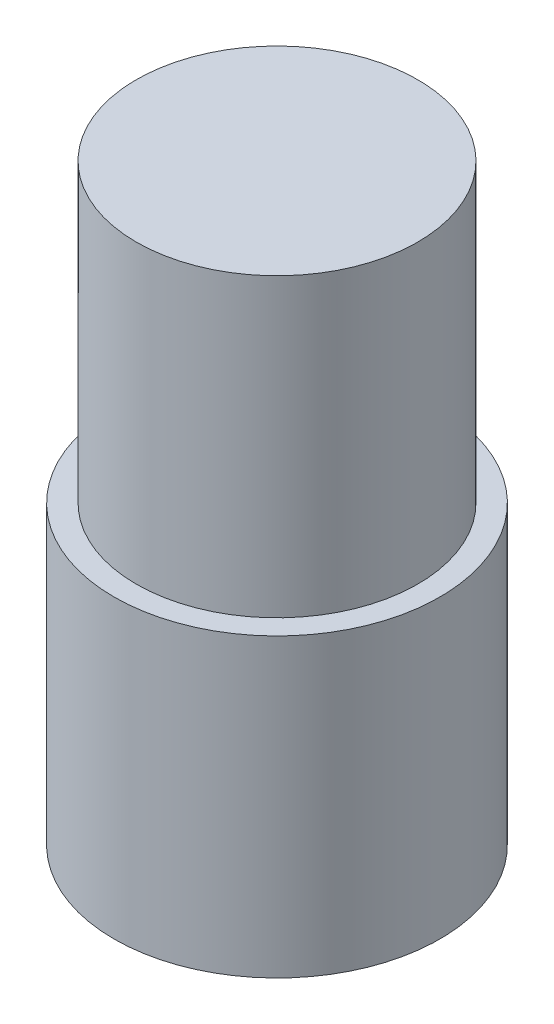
from build123d import *

# Parameters (mm, degrees)
SKETCH1_R           = 1.2065
BOSS_EXTRUDE1_DEPTH = 5.08
SKETCH2_R           = 1.397
BOSS_EXTRUDE2_DEPTH = 2.54


with BuildPart() as part:
    # Sketch1 → Boss-Extrude1 (new body)
    with BuildSketch(Plane(origin=(0, 0, 0), x_dir=(1, 0, 0), z_dir=(0, 1, 0))):
        with Locations(Location((0, 0, 0), (0, 0, 270))):
            Circle(SKETCH1_R)
    extrude(amount=BOSS_EXTRUDE1_DEPTH)

    # Sketch2 → Boss-Extrude2 (add)
    with BuildSketch(Plane.XZ):
        with Locations(Location((0, 0, 0), (0, 0, 270))):
            Circle(SKETCH2_R)
    extrude(amount=-BOSS_EXTRUDE2_DEPTH)


solid = part.part
